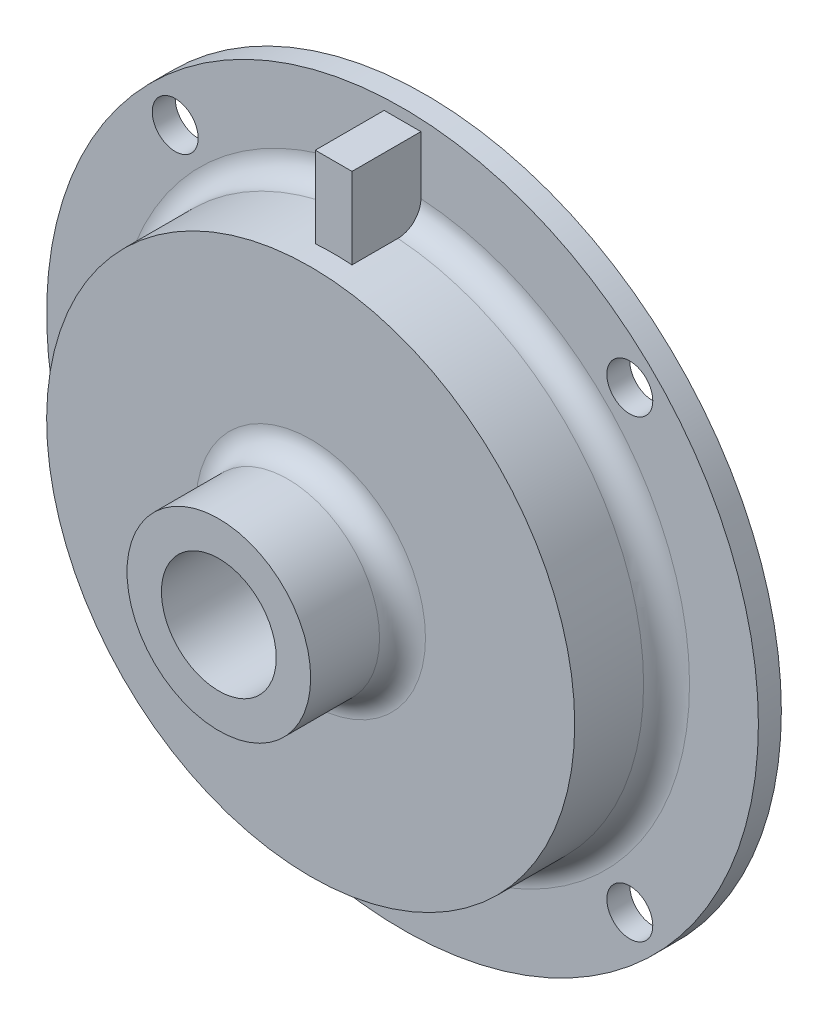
ISO-10303-21;
HEADER;
FILE_DESCRIPTION(('STEP AP214'),'2;1');
FILE_NAME('part.step','',(''),(''),'','','');
FILE_SCHEMA(('AUTOMOTIVE_DESIGN { 1 0 10303 214 1 1 1 1 }'));
ENDSEC;
DATA;
#1=APPLICATION_CONTEXT('core data for automotive mechanical design processes');
#2=APPLICATION_PROTOCOL_DEFINITION('international standard','automotive_design',2000,#1);
#3=PRODUCT_CONTEXT('',#1,'mechanical');
#4=PRODUCT('Part','Part','',(#3));
#5=PRODUCT_RELATED_PRODUCT_CATEGORY('part','',(#4));
#6=PRODUCT_DEFINITION_FORMATION('','',#4);
#7=PRODUCT_DEFINITION_CONTEXT('part definition',#1,'design');
#8=PRODUCT_DEFINITION('design','',#6,#7);
#9=PRODUCT_DEFINITION_SHAPE('','',#8);
#10=(LENGTH_UNIT() NAMED_UNIT(*) SI_UNIT(.MILLI.,.METRE.));
#11=(NAMED_UNIT(*) PLANE_ANGLE_UNIT() SI_UNIT($,.RADIAN.));
#12=(NAMED_UNIT(*) SI_UNIT($,.STERADIAN.) SOLID_ANGLE_UNIT());
#13=UNCERTAINTY_MEASURE_WITH_UNIT(LENGTH_MEASURE(1.E-05),#10,'distance_accuracy_value','');
#14=(GEOMETRIC_REPRESENTATION_CONTEXT(3) GLOBAL_UNCERTAINTY_ASSIGNED_CONTEXT((#13)) GLOBAL_UNIT_ASSIGNED_CONTEXT((#10,
#11,#12)) REPRESENTATION_CONTEXT('',''));
#15=CARTESIAN_POINT('',(0.,0.,0.));
#16=DIRECTION('',(0.,0.,1.));
#17=DIRECTION('',(1.,0.,0.));
#18=AXIS2_PLACEMENT_3D('',#15,#16,#17);
#19=CARTESIAN_POINT('',(0.,0.,3.175));
#20=DIRECTION('',(0.,0.,1.));
#21=DIRECTION('',(1.,0.,0.));
#22=AXIS2_PLACEMENT_3D('',#19,#20,#21);
#23=PLANE('',#22);
#24=CARTESIAN_POINT('',(-31.4308964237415,31.4308964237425,3.175));
#25=DIRECTION('',(0.,0.,1.));
#26=DIRECTION('',(0.,1.,0.));
#27=AXIS2_PLACEMENT_3D('',#24,#25,#26);
#28=CIRCLE('',#27,3.175);
#29=CARTESIAN_POINT('',(-31.4308964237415,34.6058964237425,3.175));
#30=VERTEX_POINT('',#29);
#31=EDGE_CURVE('E118',#30,#30,#28,.T.);
#32=ORIENTED_EDGE('',*,*,#31,.F.);
#33=EDGE_LOOP('',(#32));
#34=FACE_BOUND('',#33,.T.);
#35=CARTESIAN_POINT('',(-31.4308964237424,-31.4308964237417,3.175));
#36=DIRECTION('',(0.,0.,1.));
#37=DIRECTION('',(-1.,0.,0.));
#38=AXIS2_PLACEMENT_3D('',#35,#36,#37);
#39=CIRCLE('',#38,3.175);
#40=CARTESIAN_POINT('',(-34.6058964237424,-31.4308964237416,3.175));
#41=VERTEX_POINT('',#40);
#42=EDGE_CURVE('E124',#41,#41,#39,.T.);
#43=ORIENTED_EDGE('',*,*,#42,.F.);
#44=EDGE_LOOP('',(#43));
#45=FACE_BOUND('',#44,.T.);
#46=CARTESIAN_POINT('',(31.4308964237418,-31.4308964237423,3.175));
#47=DIRECTION('',(0.,0.,1.));
#48=DIRECTION('',(0.,-1.,0.));
#49=AXIS2_PLACEMENT_3D('',#46,#47,#48);
#50=CIRCLE('',#49,3.175);
#51=CARTESIAN_POINT('',(31.4308964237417,-34.6058964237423,3.175));
#52=VERTEX_POINT('',#51);
#53=EDGE_CURVE('E130',#52,#52,#50,.T.);
#54=ORIENTED_EDGE('',*,*,#53,.F.);
#55=EDGE_LOOP('',(#54));
#56=FACE_BOUND('',#55,.T.);
#57=CARTESIAN_POINT('',(31.4308964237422,31.4308964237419,3.175));
#58=DIRECTION('',(0.,0.,1.));
#59=DIRECTION('',(1.,0.,0.));
#60=AXIS2_PLACEMENT_3D('',#57,#58,#59);
#61=CIRCLE('',#60,3.175);
#62=CARTESIAN_POINT('',(34.6058964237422,31.4308964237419,3.175));
#63=VERTEX_POINT('',#62);
#64=EDGE_CURVE('E136',#63,#63,#61,.T.);
#65=ORIENTED_EDGE('',*,*,#64,.F.);
#66=EDGE_LOOP('',(#65));
#67=FACE_BOUND('',#66,.T.);
#68=CARTESIAN_POINT('',(0.,0.,3.175));
#69=DIRECTION('',(0.,0.,1.));
#70=DIRECTION('',(1.,0.,0.));
#71=AXIS2_PLACEMENT_3D('',#68,#69,#70);
#72=CIRCLE('',#71,49.2125);
#73=CARTESIAN_POINT('',(49.2125,0.,3.175));
#74=VERTEX_POINT('',#73);
#75=EDGE_CURVE('E145',#74,#74,#72,.T.);
#76=ORIENTED_EDGE('',*,*,#75,.T.);
#77=EDGE_LOOP('',(#76));
#78=FACE_BOUND('',#77,.T.);
#79=CARTESIAN_POINT('',(0.,0.,3.175));
#80=DIRECTION('',(0.,0.,1.));
#81=DIRECTION('',(1.,0.,0.));
#82=AXIS2_PLACEMENT_3D('',#79,#80,#81);
#83=CIRCLE('',#82,39.6875);
#84=CARTESIAN_POINT('',(2.54,39.6061365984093,3.175));
#85=VERTEX_POINT('',#84);
#86=CARTESIAN_POINT('',(-2.54,39.6061365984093,3.175));
#87=VERTEX_POINT('',#86);
#88=EDGE_CURVE('E157',#85,#87,#83,.F.);
#89=ORIENTED_EDGE('',*,*,#88,.T.);
#90=DIRECTION('',(0.,-1.,0.));
#91=VECTOR('',#90,1.);
#92=CARTESIAN_POINT('',(-2.54,47.625,3.175));
#93=LINE('',#92,#91);
#94=CARTESIAN_POINT('',(-2.54,47.625,3.175));
#95=VERTEX_POINT('',#94);
#96=EDGE_CURVE('E94',#95,#87,#93,.T.);
#97=ORIENTED_EDGE('',*,*,#96,.F.);
#98=DIRECTION('',(1.,0.,0.));
#99=VECTOR('',#98,1.);
#100=CARTESIAN_POINT('',(-2.54,47.625,3.175));
#101=LINE('',#100,#99);
#102=CARTESIAN_POINT('',(2.54,47.625,3.175));
#103=VERTEX_POINT('',#102);
#104=EDGE_CURVE('E88',#95,#103,#101,.T.);
#105=ORIENTED_EDGE('',*,*,#104,.T.);
#106=DIRECTION('',(0.,-1.,0.));
#107=VECTOR('',#106,1.);
#108=CARTESIAN_POINT('',(2.54,47.625,3.175));
#109=LINE('',#108,#107);
#110=EDGE_CURVE('E73',#103,#85,#109,.T.);
#111=ORIENTED_EDGE('',*,*,#110,.T.);
#112=EDGE_LOOP('',(#89,#97,#105,#111));
#113=FACE_BOUND('',#112,.T.);
#114=ADVANCED_FACE('F28',(#34,#45,#56,#67,#78,#113),#23,.T.);
#115=CARTESIAN_POINT('',(0.,0.,15.875));
#116=DIRECTION('',(0.,0.,-1.));
#117=DIRECTION('',(-1.,0.,0.));
#118=AXIS2_PLACEMENT_3D('',#115,#116,#117);
#119=CYLINDRICAL_SURFACE('',#118,36.5125);
#120=CARTESIAN_POINT('',(0.,0.,15.875));
#121=DIRECTION('',(0.,0.,1.));
#122=DIRECTION('',(1.,0.,0.));
#123=AXIS2_PLACEMENT_3D('',#120,#121,#122);
#124=CIRCLE('',#123,36.5125);
#125=CARTESIAN_POINT('',(36.5125,0.,15.875));
#126=VERTEX_POINT('',#125);
#127=EDGE_CURVE('E115',#126,#126,#124,.T.);
#128=ORIENTED_EDGE('',*,*,#127,.F.);
#129=EDGE_LOOP('',(#128));
#130=FACE_BOUND('',#129,.T.);
#131=DIRECTION('',(0.,0.,-1.));
#132=VECTOR('',#131,1.);
#133=CARTESIAN_POINT('',(-2.54,36.424045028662,15.875));
#134=LINE('',#133,#132);
#135=CARTESIAN_POINT('',(-2.54,36.4240450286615,6.34999999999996));
#136=VERTEX_POINT('',#135);
#137=CARTESIAN_POINT('',(-2.54,36.424045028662,12.7));
#138=VERTEX_POINT('',#137);
#139=EDGE_CURVE('E110',#136,#138,#134,.F.);
#140=ORIENTED_EDGE('',*,*,#139,.F.);
#141=CARTESIAN_POINT('',(0.,0.,6.35));
#142=DIRECTION('',(0.,0.,1.));
#143=DIRECTION('',(1.,0.,0.));
#144=AXIS2_PLACEMENT_3D('',#141,#142,#143);
#145=CIRCLE('',#144,36.5125);
#146=CARTESIAN_POINT('',(2.54,36.424045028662,6.35));
#147=VERTEX_POINT('',#146);
#148=EDGE_CURVE('E154',#136,#147,#145,.T.);
#149=ORIENTED_EDGE('',*,*,#148,.T.);
#150=DIRECTION('',(0.,0.,-1.));
#151=VECTOR('',#150,1.);
#152=CARTESIAN_POINT('',(2.54,36.424045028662,15.875));
#153=LINE('',#152,#151);
#154=CARTESIAN_POINT('',(2.54,36.424045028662,12.7));
#155=VERTEX_POINT('',#154);
#156=EDGE_CURVE('E43',#147,#155,#153,.F.);
#157=ORIENTED_EDGE('',*,*,#156,.T.);
#158=CARTESIAN_POINT('',(0.,0.,12.7));
#159=DIRECTION('',(0.,0.,-1.));
#160=DIRECTION('',(-1.,0.,0.));
#161=AXIS2_PLACEMENT_3D('',#158,#159,#160);
#162=CIRCLE('',#161,36.5125);
#163=EDGE_CURVE('E11',#138,#155,#162,.T.);
#164=ORIENTED_EDGE('',*,*,#163,.F.);
#165=EDGE_LOOP('',(#140,#149,#157,#164));
#166=FACE_BOUND('',#165,.T.);
#167=ADVANCED_FACE('F191',(#130,#166),#119,.T.);
#168=CARTESIAN_POINT('',(0.,0.,6.35));
#169=DIRECTION('',(0.,0.,1.));
#170=DIRECTION('',(1.,0.,0.));
#171=AXIS2_PLACEMENT_3D('',#168,#169,#170);
#172=TOROIDAL_SURFACE('',#171,39.6875,3.175);
#173=CARTESIAN_POINT('',(-2.54,36.6899962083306,5.07943395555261));
#174=CARTESIAN_POINT('',(-2.54,36.6186393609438,5.24247578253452));
#175=CARTESIAN_POINT('',(-2.54,36.5609878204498,5.41165600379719));
#176=CARTESIAN_POINT('',(-2.54,36.474860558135,5.75743386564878));
#177=CARTESIAN_POINT('',(-2.54,36.4464194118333,5.93404003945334));
#178=CARTESIAN_POINT('',(-2.54,36.4196176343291,6.28945791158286));
#179=CARTESIAN_POINT('',(-2.54,36.4212435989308,6.46826859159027));
#180=CARTESIAN_POINT('',(-2.54,36.4545034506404,6.82302828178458));
#181=CARTESIAN_POINT('',(-2.54,36.4861300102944,6.9989779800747));
#182=CARTESIAN_POINT('',(-2.54,36.5784580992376,7.34304476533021));
#183=CARTESIAN_POINT('',(-2.54,36.6391548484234,7.51116313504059));
#184=CARTESIAN_POINT('',(-2.54,36.7878810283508,7.8348471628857));
#185=CARTESIAN_POINT('',(-2.54,36.8759116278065,7.99041228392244));
#186=CARTESIAN_POINT('',(-2.54,37.0769053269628,8.28477235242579));
#187=CARTESIAN_POINT('',(-2.54,37.1898978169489,8.42354723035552));
#188=CARTESIAN_POINT('',(-2.54,37.4375309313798,8.68020900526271));
#189=CARTESIAN_POINT('',(-2.54,37.5721717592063,8.79809570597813));
#190=CARTESIAN_POINT('',(-2.54,37.8595935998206,9.00991005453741));
#191=CARTESIAN_POINT('',(-2.54,38.0124135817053,9.10378482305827));
#192=CARTESIAN_POINT('',(-2.54,38.3316199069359,9.26460635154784));
#193=CARTESIAN_POINT('',(-2.54,38.4980063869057,9.33155284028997));
#194=CARTESIAN_POINT('',(-2.54,38.8399872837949,9.43675108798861));
#195=CARTESIAN_POINT('',(-2.54,39.0155997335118,9.47494423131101));
#196=CARTESIAN_POINT('',(-2.54,39.3707433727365,9.52133744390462));
#197=CARTESIAN_POINT('',(-2.54,39.5502745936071,9.52953727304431));
#198=CARTESIAN_POINT('',(-2.54,39.908342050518,9.51570210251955));
#199=CARTESIAN_POINT('',(-2.54,40.0868771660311,9.4936380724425));
#200=CARTESIAN_POINT('',(-2.54,40.4377062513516,9.41983771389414));
#201=CARTESIAN_POINT('',(-2.54,40.6100002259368,9.36810140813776));
#202=CARTESIAN_POINT('',(-2.54,40.9433748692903,9.23643491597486));
#203=CARTESIAN_POINT('',(-2.54,41.1044601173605,9.15651632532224));
#204=CARTESIAN_POINT('',(-2.54,41.4109004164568,8.97073169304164));
#205=CARTESIAN_POINT('',(-2.54,41.5562555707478,8.86486582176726));
#206=CARTESIAN_POINT('',(-2.54,41.8268793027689,8.63035230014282));
#207=CARTESIAN_POINT('',(-2.54,41.9521768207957,8.50173804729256));
#208=CARTESIAN_POINT('',(-2.54,42.179353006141,8.22526581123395));
#209=CARTESIAN_POINT('',(-2.54,42.2812319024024,8.07740801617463));
#210=CARTESIAN_POINT('',(-2.54,42.45848343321,7.76693529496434));
#211=CARTESIAN_POINT('',(-2.54,42.5339040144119,7.60434774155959));
#212=CARTESIAN_POINT('',(-2.54,42.656332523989,7.26880576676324));
#213=CARTESIAN_POINT('',(-2.54,42.7033407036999,7.0958514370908));
#214=CARTESIAN_POINT('',(-2.54,42.7675460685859,6.74475934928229));
#215=CARTESIAN_POINT('',(-2.54,42.7847870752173,6.56662960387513));
#216=CARTESIAN_POINT('',(-2.54,42.7890987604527,6.21000580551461));
#217=CARTESIAN_POINT('',(-2.54,42.7761695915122,6.03151175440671));
#218=CARTESIAN_POINT('',(-2.54,42.7205293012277,5.67933975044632));
#219=CARTESIAN_POINT('',(-2.54,42.6778363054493,5.50565893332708));
#220=CARTESIAN_POINT('',(-2.54,42.5639105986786,5.16792511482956));
#221=CARTESIAN_POINT('',(-2.54,42.4926778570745,5.00387212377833));
#222=CARTESIAN_POINT('',(-2.54,42.3236701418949,4.68996492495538));
#223=CARTESIAN_POINT('',(-2.54,42.2258830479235,4.54011724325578));
#224=CARTESIAN_POINT('',(-2.54,42.0065717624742,4.25893724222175));
#225=CARTESIAN_POINT('',(-2.54,41.8850474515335,4.12760501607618));
#226=CARTESIAN_POINT('',(-2.54,41.6215377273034,3.88698678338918));
#227=CARTESIAN_POINT('',(-2.54,41.4795245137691,3.77773122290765));
#228=CARTESIAN_POINT('',(-2.54,41.1791984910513,3.58456183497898));
#229=CARTESIAN_POINT('',(-2.54,41.0208854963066,3.50064829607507));
#230=CARTESIAN_POINT('',(-2.54,40.6921477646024,3.36038485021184));
#231=CARTESIAN_POINT('',(-2.54,40.5217016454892,3.30408505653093));
#232=CARTESIAN_POINT('',(-2.54,40.1737838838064,3.22084999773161));
#233=CARTESIAN_POINT('',(-2.54,39.9963121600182,3.19391507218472));
#234=CARTESIAN_POINT('',(-2.54,39.6390821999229,3.17014001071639));
#235=CARTESIAN_POINT('',(-2.54,39.4593207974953,3.17334743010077));
#236=CARTESIAN_POINT('',(-2.54,39.1028903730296,3.20987613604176));
#237=CARTESIAN_POINT('',(-2.54,38.9262212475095,3.24319641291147));
#238=CARTESIAN_POINT('',(-2.54,38.5808924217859,3.33903427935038));
#239=CARTESIAN_POINT('',(-2.54,38.4122367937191,3.40156654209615));
#240=CARTESIAN_POINT('',(-2.54,38.0877836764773,3.55409882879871));
#241=CARTESIAN_POINT('',(-2.54,37.9319893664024,3.64410561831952));
#242=CARTESIAN_POINT('',(-2.54,37.6378048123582,3.8489952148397));
#243=CARTESIAN_POINT('',(-2.54,37.4994098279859,3.96387122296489));
#244=CARTESIAN_POINT('',(-2.54,37.2440519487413,4.21518950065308));
#245=CARTESIAN_POINT('',(-2.54,37.1270632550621,4.35160543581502));
#246=CARTESIAN_POINT('',(-2.54,36.9569430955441,4.58768283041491));
#247=CARTESIAN_POINT('',(-2.54,36.8962887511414,4.6820207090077));
#248=CARTESIAN_POINT('',(-2.54,36.7852775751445,4.87657269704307));
#249=CARTESIAN_POINT('',(-2.54,36.7349207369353,4.97678680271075));
#250=CARTESIAN_POINT('',(-2.54,36.6899962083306,5.07943395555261));
#251=B_SPLINE_CURVE_WITH_KNOTS('',3,(#173,#174,#175,#176,#177,#178,#179,#180,#181,#182,#183,
#184,#185,#186,#187,#188,#189,#190,#191,#192,#193,#194,#195,#196,#197,#198,#199,#200,#201,#202,
#203,#204,#205,#206,#207,#208,#209,#210,#211,#212,#213,#214,#215,#216,#217,#218,#219,#220,#221,
#222,#223,#224,#225,#226,#227,#228,#229,#230,#231,#232,#233,#234,#235,#236,#237,#238,#239,#240,
#241,#242,#243,#244,#245,#246,#247,#248,#249,#250),.UNSPECIFIED.,.T.,.F.,(4,2,2,2,2,2,2,2,2,2,2,
2,2,2,2,2,2,2,2,2,2,2,2,2,2,2,2,2,2,2,2,2,2,2,2,2,2,2,4),(0.,0.533510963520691,1.06765270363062,
1.60155632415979,2.13532957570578,2.66901508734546,3.20272342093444,3.73706352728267,
4.2714086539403,4.8069205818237,5.34243790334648,5.87904397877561,6.41565435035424,
6.95277982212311,7.48990488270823,8.02680919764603,8.56370998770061,9.09982898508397,
9.63594274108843,10.1710798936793,10.7062123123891,11.2405562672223,11.7748975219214,
12.3089136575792,12.8429303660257,13.377191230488,13.9114547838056,14.4464501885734,
14.9814516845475,15.5174205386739,16.0533955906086,16.5902163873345,17.1270191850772,
17.6640919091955,18.2012969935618,18.7383553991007,19.2747622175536,19.6106479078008,
19.9465333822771),.UNSPECIFIED.);
#252=EDGE_CURVE('E36',#87,#136,#251,.T.);
#253=ORIENTED_EDGE('',*,*,#252,.F.);
#254=ORIENTED_EDGE('',*,*,#88,.F.);
#255=CARTESIAN_POINT('',(2.54,36.6899962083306,5.07943395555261));
#256=CARTESIAN_POINT('',(2.54,36.6186393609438,5.24247578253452));
#257=CARTESIAN_POINT('',(2.54,36.5609878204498,5.41165600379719));
#258=CARTESIAN_POINT('',(2.54,36.474860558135,5.75743386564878));
#259=CARTESIAN_POINT('',(2.54,36.4464194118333,5.93404003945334));
#260=CARTESIAN_POINT('',(2.54,36.4196176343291,6.28945791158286));
#261=CARTESIAN_POINT('',(2.54,36.4212435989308,6.46826859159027));
#262=CARTESIAN_POINT('',(2.54,36.4545034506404,6.82302828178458));
#263=CARTESIAN_POINT('',(2.54,36.4861300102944,6.9989779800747));
#264=CARTESIAN_POINT('',(2.54,36.5784580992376,7.34304476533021));
#265=CARTESIAN_POINT('',(2.54,36.6391548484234,7.51116313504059));
#266=CARTESIAN_POINT('',(2.54,36.7878810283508,7.8348471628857));
#267=CARTESIAN_POINT('',(2.54,36.8759116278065,7.99041228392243));
#268=CARTESIAN_POINT('',(2.54,37.0769053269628,8.28477235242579));
#269=CARTESIAN_POINT('',(2.54,37.1898978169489,8.42354723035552));
#270=CARTESIAN_POINT('',(2.54,37.4375309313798,8.68020900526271));
#271=CARTESIAN_POINT('',(2.54,37.5721717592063,8.79809570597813));
#272=CARTESIAN_POINT('',(2.54,37.8595935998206,9.00991005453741));
#273=CARTESIAN_POINT('',(2.54,38.0124135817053,9.10378482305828));
#274=CARTESIAN_POINT('',(2.54,38.3316199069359,9.26460635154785));
#275=CARTESIAN_POINT('',(2.54,38.4980063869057,9.33155284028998));
#276=CARTESIAN_POINT('',(2.54,38.8399872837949,9.43675108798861));
#277=CARTESIAN_POINT('',(2.54,39.0155997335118,9.47494423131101));
#278=CARTESIAN_POINT('',(2.54,39.3707433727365,9.52133744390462));
#279=CARTESIAN_POINT('',(2.54,39.5502745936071,9.52953727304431));
#280=CARTESIAN_POINT('',(2.54,39.908342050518,9.51570210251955));
#281=CARTESIAN_POINT('',(2.54,40.0868771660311,9.4936380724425));
#282=CARTESIAN_POINT('',(2.54,40.4377062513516,9.41983771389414));
#283=CARTESIAN_POINT('',(2.54,40.6100002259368,9.36810140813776));
#284=CARTESIAN_POINT('',(2.54,40.9433748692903,9.23643491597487));
#285=CARTESIAN_POINT('',(2.54,41.1044601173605,9.15651632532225));
#286=CARTESIAN_POINT('',(2.54,41.4109004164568,8.97073169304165));
#287=CARTESIAN_POINT('',(2.54,41.5562555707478,8.86486582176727));
#288=CARTESIAN_POINT('',(2.54,41.8268793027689,8.63035230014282));
#289=CARTESIAN_POINT('',(2.54,41.9521768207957,8.50173804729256));
#290=CARTESIAN_POINT('',(2.54,42.179353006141,8.22526581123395));
#291=CARTESIAN_POINT('',(2.54,42.2812319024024,8.07740801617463));
#292=CARTESIAN_POINT('',(2.54,42.45848343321,7.76693529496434));
#293=CARTESIAN_POINT('',(2.54,42.5339040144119,7.60434774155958));
#294=CARTESIAN_POINT('',(2.54,42.656332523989,7.26880576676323));
#295=CARTESIAN_POINT('',(2.54,42.7033407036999,7.0958514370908));
#296=CARTESIAN_POINT('',(2.54,42.7675460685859,6.74475934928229));
#297=CARTESIAN_POINT('',(2.54,42.7847870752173,6.56662960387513));
#298=CARTESIAN_POINT('',(2.54,42.7890987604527,6.21000580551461));
#299=CARTESIAN_POINT('',(2.54,42.7761695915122,6.03151175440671));
#300=CARTESIAN_POINT('',(2.54,42.7205293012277,5.67933975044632));
#301=CARTESIAN_POINT('',(2.54,42.6778363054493,5.50565893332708));
#302=CARTESIAN_POINT('',(2.54,42.5639105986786,5.16792511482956));
#303=CARTESIAN_POINT('',(2.54,42.4926778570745,5.00387212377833));
#304=CARTESIAN_POINT('',(2.54,42.3236701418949,4.68996492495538));
#305=CARTESIAN_POINT('',(2.54,42.2258830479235,4.54011724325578));
#306=CARTESIAN_POINT('',(2.54,42.0065717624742,4.25893724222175));
#307=CARTESIAN_POINT('',(2.54,41.8850474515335,4.12760501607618));
#308=CARTESIAN_POINT('',(2.54,41.6215377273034,3.88698678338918));
#309=CARTESIAN_POINT('',(2.54,41.4795245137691,3.77773122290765));
#310=CARTESIAN_POINT('',(2.54,41.1791984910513,3.58456183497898));
#311=CARTESIAN_POINT('',(2.54,41.0208854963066,3.50064829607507));
#312=CARTESIAN_POINT('',(2.54,40.6921477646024,3.36038485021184));
#313=CARTESIAN_POINT('',(2.54,40.5217016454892,3.30408505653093));
#314=CARTESIAN_POINT('',(2.54,40.1737838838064,3.22084999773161));
#315=CARTESIAN_POINT('',(2.54,39.9963121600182,3.19391507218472));
#316=CARTESIAN_POINT('',(2.54,39.6390821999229,3.17014001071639));
#317=CARTESIAN_POINT('',(2.54,39.4593207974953,3.17334743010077));
#318=CARTESIAN_POINT('',(2.54,39.1028903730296,3.20987613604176));
#319=CARTESIAN_POINT('',(2.54,38.9262212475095,3.24319641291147));
#320=CARTESIAN_POINT('',(2.54,38.5808924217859,3.33903427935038));
#321=CARTESIAN_POINT('',(2.54,38.4122367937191,3.40156654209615));
#322=CARTESIAN_POINT('',(2.54,38.0877836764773,3.55409882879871));
#323=CARTESIAN_POINT('',(2.54,37.9319893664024,3.64410561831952));
#324=CARTESIAN_POINT('',(2.54,37.6378048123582,3.8489952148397));
#325=CARTESIAN_POINT('',(2.54,37.4994098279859,3.96387122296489));
#326=CARTESIAN_POINT('',(2.54,37.2440519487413,4.21518950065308));
#327=CARTESIAN_POINT('',(2.54,37.1270632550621,4.35160543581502));
#328=CARTESIAN_POINT('',(2.54,36.9569430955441,4.58768283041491));
#329=CARTESIAN_POINT('',(2.54,36.8962887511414,4.6820207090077));
#330=CARTESIAN_POINT('',(2.54,36.7852775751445,4.87657269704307));
#331=CARTESIAN_POINT('',(2.54,36.7349207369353,4.97678680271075));
#332=CARTESIAN_POINT('',(2.54,36.6899962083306,5.07943395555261));
#333=B_SPLINE_CURVE_WITH_KNOTS('',3,(#255,#256,#257,#258,#259,#260,#261,#262,#263,#264,#265,
#266,#267,#268,#269,#270,#271,#272,#273,#274,#275,#276,#277,#278,#279,#280,#281,#282,#283,#284,
#285,#286,#287,#288,#289,#290,#291,#292,#293,#294,#295,#296,#297,#298,#299,#300,#301,#302,#303,
#304,#305,#306,#307,#308,#309,#310,#311,#312,#313,#314,#315,#316,#317,#318,#319,#320,#321,#322,
#323,#324,#325,#326,#327,#328,#329,#330,#331,#332),.UNSPECIFIED.,.T.,.F.,(4,2,2,2,2,2,2,2,2,2,2,
2,2,2,2,2,2,2,2,2,2,2,2,2,2,2,2,2,2,2,2,2,2,2,2,2,2,2,4),(0.,0.533510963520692,1.06765270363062,
1.60155632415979,2.13532957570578,2.66901508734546,3.20272342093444,3.73706352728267,
4.27140865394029,4.80692058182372,5.34243790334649,5.87904397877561,6.41565435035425,
6.95277982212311,7.48990488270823,8.02680919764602,8.56370998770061,9.09982898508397,
9.63594274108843,10.1710798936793,10.7062123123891,11.2405562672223,11.7748975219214,
12.3089136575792,12.8429303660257,13.377191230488,13.9114547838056,14.4464501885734,
14.9814516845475,15.5174205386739,16.0533955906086,16.5902163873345,17.1270191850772,
17.6640919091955,18.2012969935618,18.7383553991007,19.2747622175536,19.6106479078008,
19.9465333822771),.UNSPECIFIED.);
#334=EDGE_CURVE('E77',#85,#147,#333,.T.);
#335=ORIENTED_EDGE('',*,*,#334,.T.);
#336=ORIENTED_EDGE('',*,*,#148,.F.);
#337=EDGE_LOOP('',(#253,#254,#335,#336));
#338=FACE_BOUND('',#337,.T.);
#339=ADVANCED_FACE('F166',(#338),#172,.F.);
#340=CARTESIAN_POINT('',(0.,0.,15.875));
#341=DIRECTION('',(0.,0.,1.));
#342=DIRECTION('',(1.,0.,0.));
#343=AXIS2_PLACEMENT_3D('',#340,#341,#342);
#344=PLANE('',#343);
#345=CARTESIAN_POINT('',(0.,0.,15.875));
#346=DIRECTION('',(0.,0.,1.));
#347=DIRECTION('',(1.,0.,0.));
#348=AXIS2_PLACEMENT_3D('',#345,#346,#347);
#349=CIRCLE('',#348,15.875);
#350=CARTESIAN_POINT('',(15.875,0.,15.875));
#351=VERTEX_POINT('',#350);
#352=EDGE_CURVE('E151',#351,#351,#349,.F.);
#353=ORIENTED_EDGE('',*,*,#352,.T.);
#354=EDGE_LOOP('',(#353));
#355=FACE_BOUND('',#354,.T.);
#356=ORIENTED_EDGE('',*,*,#127,.T.);
#357=EDGE_LOOP('',(#356));
#358=FACE_BOUND('',#357,.T.);
#359=ADVANCED_FACE('F223',(#355,#358),#344,.T.);
#360=CARTESIAN_POINT('',(0.,0.,3.175));
#361=DIRECTION('',(0.,0.,-1.));
#362=DIRECTION('',(-1.,0.,0.));
#363=AXIS2_PLACEMENT_3D('',#360,#361,#362);
#364=CYLINDRICAL_SURFACE('',#363,49.2125);
#365=ORIENTED_EDGE('',*,*,#75,.F.);
#366=EDGE_LOOP('',(#365));
#367=FACE_BOUND('',#366,.T.);
#368=CARTESIAN_POINT('',(0.,0.,0.));
#369=DIRECTION('',(0.,0.,1.));
#370=DIRECTION('',(1.,0.,0.));
#371=AXIS2_PLACEMENT_3D('',#368,#369,#370);
#372=CIRCLE('',#371,49.2125);
#373=CARTESIAN_POINT('',(49.2125,0.,0.));
#374=VERTEX_POINT('',#373);
#375=EDGE_CURVE('E142',#374,#374,#372,.T.);
#376=ORIENTED_EDGE('',*,*,#375,.T.);
#377=EDGE_LOOP('',(#376));
#378=FACE_BOUND('',#377,.T.);
#379=ADVANCED_FACE('F30',(#367,#378),#364,.T.);
#380=CARTESIAN_POINT('',(0.,0.,0.));
#381=DIRECTION('',(0.,0.,1.));
#382=DIRECTION('',(1.,0.,0.));
#383=AXIS2_PLACEMENT_3D('',#380,#381,#382);
#384=PLANE('',#383);
#385=CARTESIAN_POINT('',(0.,0.,0.));
#386=DIRECTION('',(0.,0.,1.));
#387=DIRECTION('',(1.,0.,0.));
#388=AXIS2_PLACEMENT_3D('',#385,#386,#387);
#389=CIRCLE('',#388,7.9375);
#390=CARTESIAN_POINT('',(7.9375,0.,0.));
#391=VERTEX_POINT('',#390);
#392=EDGE_CURVE('E95',#391,#391,#389,.T.);
#393=ORIENTED_EDGE('',*,*,#392,.T.);
#394=EDGE_LOOP('',(#393));
#395=FACE_BOUND('',#394,.T.);
#396=CARTESIAN_POINT('',(-31.4308964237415,31.4308964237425,0.));
#397=DIRECTION('',(0.,0.,1.));
#398=DIRECTION('',(0.,1.,0.));
#399=AXIS2_PLACEMENT_3D('',#396,#397,#398);
#400=CIRCLE('',#399,3.175);
#401=CARTESIAN_POINT('',(-31.4308964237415,34.6058964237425,0.));
#402=VERTEX_POINT('',#401);
#403=EDGE_CURVE('E121',#402,#402,#400,.T.);
#404=ORIENTED_EDGE('',*,*,#403,.T.);
#405=EDGE_LOOP('',(#404));
#406=FACE_BOUND('',#405,.T.);
#407=CARTESIAN_POINT('',(-31.4308964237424,-31.4308964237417,0.));
#408=DIRECTION('',(0.,0.,1.));
#409=DIRECTION('',(-1.,0.,0.));
#410=AXIS2_PLACEMENT_3D('',#407,#408,#409);
#411=CIRCLE('',#410,3.175);
#412=CARTESIAN_POINT('',(-34.6058964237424,-31.4308964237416,0.));
#413=VERTEX_POINT('',#412);
#414=EDGE_CURVE('E127',#413,#413,#411,.T.);
#415=ORIENTED_EDGE('',*,*,#414,.T.);
#416=EDGE_LOOP('',(#415));
#417=FACE_BOUND('',#416,.T.);
#418=CARTESIAN_POINT('',(31.4308964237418,-31.4308964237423,0.));
#419=DIRECTION('',(0.,0.,1.));
#420=DIRECTION('',(0.,-1.,0.));
#421=AXIS2_PLACEMENT_3D('',#418,#419,#420);
#422=CIRCLE('',#421,3.175);
#423=CARTESIAN_POINT('',(31.4308964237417,-34.6058964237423,0.));
#424=VERTEX_POINT('',#423);
#425=EDGE_CURVE('E133',#424,#424,#422,.T.);
#426=ORIENTED_EDGE('',*,*,#425,.T.);
#427=EDGE_LOOP('',(#426));
#428=FACE_BOUND('',#427,.T.);
#429=CARTESIAN_POINT('',(31.4308964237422,31.4308964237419,0.));
#430=DIRECTION('',(0.,0.,1.));
#431=DIRECTION('',(1.,0.,0.));
#432=AXIS2_PLACEMENT_3D('',#429,#430,#431);
#433=CIRCLE('',#432,3.175);
#434=CARTESIAN_POINT('',(34.6058964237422,31.4308964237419,0.));
#435=VERTEX_POINT('',#434);
#436=EDGE_CURVE('E139',#435,#435,#433,.T.);
#437=ORIENTED_EDGE('',*,*,#436,.T.);
#438=EDGE_LOOP('',(#437));
#439=FACE_BOUND('',#438,.T.);
#440=ORIENTED_EDGE('',*,*,#375,.F.);
#441=EDGE_LOOP('',(#440));
#442=FACE_BOUND('',#441,.T.);
#443=ADVANCED_FACE('F202',(#395,#406,#417,#428,#439,#442),#384,.F.);
#444=CARTESIAN_POINT('',(31.4308964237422,31.4308964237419,0.));
#445=DIRECTION('',(0.,0.,1.));
#446=DIRECTION('',(1.,0.,0.));
#447=AXIS2_PLACEMENT_3D('',#444,#445,#446);
#448=CYLINDRICAL_SURFACE('',#447,3.175);
#449=ORIENTED_EDGE('',*,*,#436,.F.);
#450=EDGE_LOOP('',(#449));
#451=FACE_BOUND('',#450,.T.);
#452=ORIENTED_EDGE('',*,*,#64,.T.);
#453=EDGE_LOOP('',(#452));
#454=FACE_BOUND('',#453,.T.);
#455=ADVANCED_FACE('F205',(#451,#454),#448,.F.);
#456=CARTESIAN_POINT('',(31.4308964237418,-31.4308964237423,0.));
#457=DIRECTION('',(0.,0.,1.));
#458=DIRECTION('',(1.,0.,0.));
#459=AXIS2_PLACEMENT_3D('',#456,#457,#458);
#460=CYLINDRICAL_SURFACE('',#459,3.175);
#461=ORIENTED_EDGE('',*,*,#425,.F.);
#462=EDGE_LOOP('',(#461));
#463=FACE_BOUND('',#462,.T.);
#464=ORIENTED_EDGE('',*,*,#53,.T.);
#465=EDGE_LOOP('',(#464));
#466=FACE_BOUND('',#465,.T.);
#467=ADVANCED_FACE('F209',(#463,#466),#460,.F.);
#468=CARTESIAN_POINT('',(-31.4308964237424,-31.4308964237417,0.));
#469=DIRECTION('',(0.,0.,1.));
#470=DIRECTION('',(1.,0.,0.));
#471=AXIS2_PLACEMENT_3D('',#468,#469,#470);
#472=CYLINDRICAL_SURFACE('',#471,3.175);
#473=ORIENTED_EDGE('',*,*,#414,.F.);
#474=EDGE_LOOP('',(#473));
#475=FACE_BOUND('',#474,.T.);
#476=ORIENTED_EDGE('',*,*,#42,.T.);
#477=EDGE_LOOP('',(#476));
#478=FACE_BOUND('',#477,.T.);
#479=ADVANCED_FACE('F213',(#475,#478),#472,.F.);
#480=CARTESIAN_POINT('',(-31.4308964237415,31.4308964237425,0.));
#481=DIRECTION('',(0.,0.,1.));
#482=DIRECTION('',(1.,0.,0.));
#483=AXIS2_PLACEMENT_3D('',#480,#481,#482);
#484=CYLINDRICAL_SURFACE('',#483,3.175);
#485=ORIENTED_EDGE('',*,*,#403,.F.);
#486=EDGE_LOOP('',(#485));
#487=FACE_BOUND('',#486,.T.);
#488=ORIENTED_EDGE('',*,*,#31,.T.);
#489=EDGE_LOOP('',(#488));
#490=FACE_BOUND('',#489,.T.);
#491=ADVANCED_FACE('F217',(#487,#490),#484,.F.);
#492=CARTESIAN_POINT('',(0.,0.,28.575));
#493=DIRECTION('',(0.,0.,-1.));
#494=DIRECTION('',(-1.,0.,0.));
#495=AXIS2_PLACEMENT_3D('',#492,#493,#494);
#496=CYLINDRICAL_SURFACE('',#495,12.7);
#497=CARTESIAN_POINT('',(0.,0.,19.05));
#498=DIRECTION('',(0.,0.,1.));
#499=DIRECTION('',(1.,0.,0.));
#500=AXIS2_PLACEMENT_3D('',#497,#498,#499);
#501=CIRCLE('',#500,12.7);
#502=CARTESIAN_POINT('',(12.7,0.,19.05));
#503=VERTEX_POINT('',#502);
#504=EDGE_CURVE('E148',#503,#503,#501,.T.);
#505=ORIENTED_EDGE('',*,*,#504,.T.);
#506=EDGE_LOOP('',(#505));
#507=FACE_BOUND('',#506,.T.);
#508=CARTESIAN_POINT('',(0.,0.,28.575));
#509=DIRECTION('',(0.,0.,1.));
#510=DIRECTION('',(1.,0.,0.));
#511=AXIS2_PLACEMENT_3D('',#508,#509,#510);
#512=CIRCLE('',#511,12.7);
#513=CARTESIAN_POINT('',(12.7,0.,28.575));
#514=VERTEX_POINT('',#513);
#515=EDGE_CURVE('E112',#514,#514,#512,.T.);
#516=ORIENTED_EDGE('',*,*,#515,.F.);
#517=EDGE_LOOP('',(#516));
#518=FACE_BOUND('',#517,.T.);
#519=ADVANCED_FACE('F220',(#507,#518),#496,.T.);
#520=CARTESIAN_POINT('',(0.,0.,28.575));
#521=DIRECTION('',(0.,0.,1.));
#522=DIRECTION('',(1.,0.,0.));
#523=AXIS2_PLACEMENT_3D('',#520,#521,#522);
#524=PLANE('',#523);
#525=CARTESIAN_POINT('',(0.,0.,28.575));
#526=DIRECTION('',(0.,0.,1.));
#527=DIRECTION('',(1.,0.,0.));
#528=AXIS2_PLACEMENT_3D('',#525,#526,#527);
#529=CIRCLE('',#528,7.9375);
#530=CARTESIAN_POINT('',(7.9375,0.,28.575));
#531=VERTEX_POINT('',#530);
#532=EDGE_CURVE('E98',#531,#531,#529,.T.);
#533=ORIENTED_EDGE('',*,*,#532,.F.);
#534=EDGE_LOOP('',(#533));
#535=FACE_BOUND('',#534,.T.);
#536=ORIENTED_EDGE('',*,*,#515,.T.);
#537=EDGE_LOOP('',(#536));
#538=FACE_BOUND('',#537,.T.);
#539=ADVANCED_FACE('F229',(#535,#538),#524,.T.);
#540=CARTESIAN_POINT('',(0.,0.,19.05));
#541=DIRECTION('',(0.,0.,1.));
#542=DIRECTION('',(1.,0.,0.));
#543=AXIS2_PLACEMENT_3D('',#540,#541,#542);
#544=TOROIDAL_SURFACE('',#543,15.875,3.175);
#545=ORIENTED_EDGE('',*,*,#352,.F.);
#546=EDGE_LOOP('',(#545));
#547=FACE_BOUND('',#546,.T.);
#548=ORIENTED_EDGE('',*,*,#504,.F.);
#549=EDGE_LOOP('',(#548));
#550=FACE_BOUND('',#549,.T.);
#551=ADVANCED_FACE('F175',(#547,#550),#544,.F.);
#552=CARTESIAN_POINT('',(-2.54,47.625,12.7));
#553=DIRECTION('',(0.,0.,-1.));
#554=DIRECTION('',(-1.,0.,0.));
#555=AXIS2_PLACEMENT_3D('',#552,#553,#554);
#556=PLANE('',#555);
#557=DIRECTION('',(0.,-1.,0.));
#558=VECTOR('',#557,1.);
#559=CARTESIAN_POINT('',(-2.54,47.625,12.7));
#560=LINE('',#559,#558);
#561=CARTESIAN_POINT('',(-2.54,47.625,12.7));
#562=VERTEX_POINT('',#561);
#563=EDGE_CURVE('E105',#562,#138,#560,.T.);
#564=ORIENTED_EDGE('',*,*,#563,.T.);
#565=ORIENTED_EDGE('',*,*,#163,.T.);
#566=DIRECTION('',(0.,-1.,0.));
#567=VECTOR('',#566,1.);
#568=CARTESIAN_POINT('',(2.54,47.625,12.7));
#569=LINE('',#568,#567);
#570=CARTESIAN_POINT('',(2.54,47.625,12.7));
#571=VERTEX_POINT('',#570);
#572=EDGE_CURVE('E82',#571,#155,#569,.T.);
#573=ORIENTED_EDGE('',*,*,#572,.F.);
#574=DIRECTION('',(1.,0.,0.));
#575=VECTOR('',#574,1.);
#576=CARTESIAN_POINT('',(-2.54,47.625,12.7));
#577=LINE('',#576,#575);
#578=EDGE_CURVE('E91',#562,#571,#577,.T.);
#579=ORIENTED_EDGE('',*,*,#578,.F.);
#580=EDGE_LOOP('',(#564,#565,#573,#579));
#581=FACE_BOUND('',#580,.T.);
#582=ADVANCED_FACE('F173',(#581),#556,.F.);
#583=CARTESIAN_POINT('',(-2.54,47.625,3.175));
#584=DIRECTION('',(1.,0.,0.));
#585=DIRECTION('',(0.,0.,-1.));
#586=AXIS2_PLACEMENT_3D('',#583,#584,#585);
#587=PLANE('',#586);
#588=ORIENTED_EDGE('',*,*,#252,.T.);
#589=ORIENTED_EDGE('',*,*,#139,.T.);
#590=ORIENTED_EDGE('',*,*,#563,.F.);
#591=DIRECTION('',(0.,0.,1.));
#592=VECTOR('',#591,1.);
#593=CARTESIAN_POINT('',(-2.54,47.625,3.175));
#594=LINE('',#593,#592);
#595=EDGE_CURVE('E83',#95,#562,#594,.T.);
#596=ORIENTED_EDGE('',*,*,#595,.F.);
#597=ORIENTED_EDGE('',*,*,#96,.T.);
#598=EDGE_LOOP('',(#588,#589,#590,#596,#597));
#599=FACE_BOUND('',#598,.T.);
#600=ADVANCED_FACE('F172',(#599),#587,.F.);
#601=CARTESIAN_POINT('',(2.54,47.625,3.175));
#602=DIRECTION('',(1.,0.,0.));
#603=DIRECTION('',(0.,0.,-1.));
#604=AXIS2_PLACEMENT_3D('',#601,#602,#603);
#605=PLANE('',#604);
#606=ORIENTED_EDGE('',*,*,#156,.F.);
#607=ORIENTED_EDGE('',*,*,#334,.F.);
#608=ORIENTED_EDGE('',*,*,#110,.F.);
#609=DIRECTION('',(0.,0.,1.));
#610=VECTOR('',#609,1.);
#611=CARTESIAN_POINT('',(2.54,47.625,3.175));
#612=LINE('',#611,#610);
#613=EDGE_CURVE('E76',#103,#571,#612,.T.);
#614=ORIENTED_EDGE('',*,*,#613,.T.);
#615=ORIENTED_EDGE('',*,*,#572,.T.);
#616=EDGE_LOOP('',(#606,#607,#608,#614,#615));
#617=FACE_BOUND('',#616,.T.);
#618=ADVANCED_FACE('F75',(#617),#605,.T.);
#619=CARTESIAN_POINT('',(2.54,47.625,3.175));
#620=DIRECTION('',(0.,-1.,0.));
#621=DIRECTION('',(0.,0.,-1.));
#622=AXIS2_PLACEMENT_3D('',#619,#620,#621);
#623=PLANE('',#622);
#624=ORIENTED_EDGE('',*,*,#104,.F.);
#625=ORIENTED_EDGE('',*,*,#595,.T.);
#626=ORIENTED_EDGE('',*,*,#578,.T.);
#627=ORIENTED_EDGE('',*,*,#613,.F.);
#628=EDGE_LOOP('',(#624,#625,#626,#627));
#629=FACE_BOUND('',#628,.T.);
#630=ADVANCED_FACE('F87',(#629),#623,.F.);
#631=CARTESIAN_POINT('',(0.,0.,0.));
#632=DIRECTION('',(0.,0.,1.));
#633=DIRECTION('',(1.,0.,0.));
#634=AXIS2_PLACEMENT_3D('',#631,#632,#633);
#635=CYLINDRICAL_SURFACE('',#634,7.9375);
#636=ORIENTED_EDGE('',*,*,#392,.F.);
#637=EDGE_LOOP('',(#636));
#638=FACE_BOUND('',#637,.T.);
#639=ORIENTED_EDGE('',*,*,#532,.T.);
#640=EDGE_LOOP('',(#639));
#641=FACE_BOUND('',#640,.T.);
#642=ADVANCED_FACE('F182',(#638,#641),#635,.F.);
#643=CLOSED_SHELL('',(#114,#167,#339,#359,#379,#443,#455,#467,#479,#491,#519,#539,#551,#582,
#600,#618,#630,#642));
#644=MANIFOLD_SOLID_BREP('B2',#643);
#645=ADVANCED_BREP_SHAPE_REPRESENTATION('',(#18,#644),#14);
#646=SHAPE_DEFINITION_REPRESENTATION(#9,#645);
ENDSEC;
END-ISO-10303-21;
